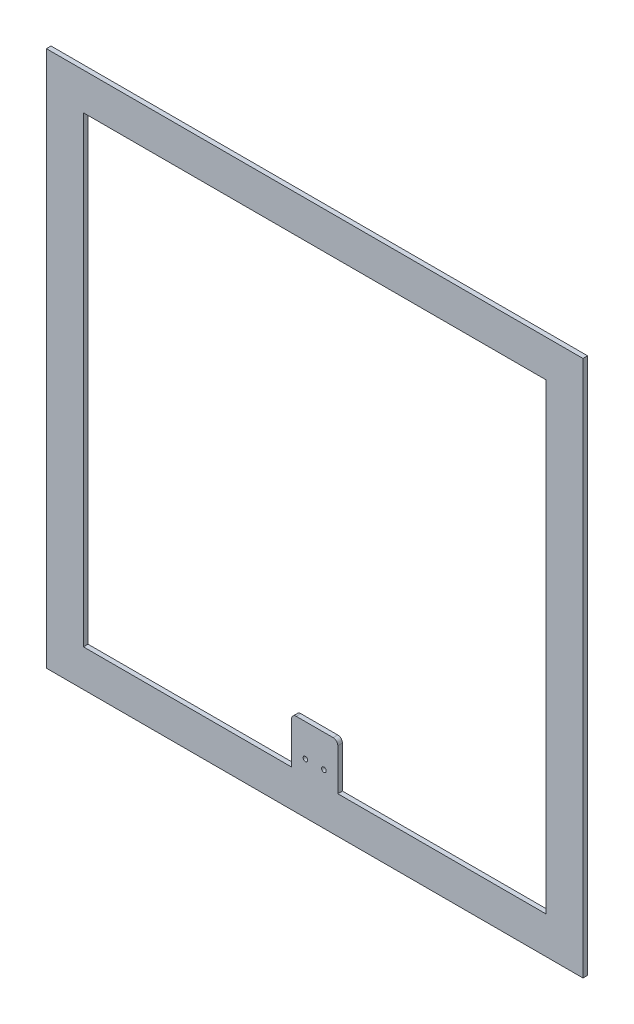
from build123d import *

# Parameters (mm, degrees)
ESQUISSE1_W             = 580
ESQUISSE1_H             = 580
BOSS_EXTRU_1_DEPTH      = 5
ENL_V_MAT_EXTRU_1_REACH = 412.152
ESQUISSE2_R             = 2.5
CONG_1_R                = 5


with BuildPart() as part:
    # Esquisse1 → Boss.-Extru.1 (new body)
    with BuildSketch(Plane.XY):
        Rectangle(ESQUISSE1_W, ESQUISSE1_H)
        Polygon((-250, 250), (250, 250), (250, -250), (25, -250), (25, -200), (-25, -200), (-25, -250), (-250, -250), align=None, mode=Mode.SUBTRACT)
    extrude(amount=BOSS_EXTRU_1_DEPTH)

    # Esquisse2 → Enl_v. mat.-Extru.1 (cut, up to next)
    with BuildSketch(Plane.XY.offset(5), mode=Mode.PRIVATE) as enl_v_mat_extru_1_sk1:
        with Locations((-10, -235)):
            Circle(ESQUISSE2_R)
    enl_v_mat_extru_1_tool1 = extrude(enl_v_mat_extru_1_sk1.sketch, amount=-ENL_V_MAT_EXTRU_1_REACH, mode=Mode.PRIVATE) & part.part
    # Esquisse2 → Enl_v. mat.-Extru.1 (cut, up to next)
    with BuildSketch(Plane.XY.offset(5), mode=Mode.PRIVATE) as enl_v_mat_extru_1_sk2:
        with Locations((10, -235)):
            Circle(ESQUISSE2_R)
    enl_v_mat_extru_1_tool2 = extrude(enl_v_mat_extru_1_sk2.sketch, amount=-ENL_V_MAT_EXTRU_1_REACH, mode=Mode.PRIVATE) & part.part
    add(enl_v_mat_extru_1_tool1.solids().sort_by_distance((-10, -235, 5))[0], mode=Mode.SUBTRACT)
    add(enl_v_mat_extru_1_tool2.solids().sort_by_distance((10, -235, 5))[0], mode=Mode.SUBTRACT)

    # Cong_1
    cong_1_edges = [part.edges().sort_by_distance(p)[0] for p in [
        (-25, -200, 2.5),
        (25, -200, 2.5),
    ]]
    fillet(cong_1_edges, radius=CONG_1_R)


solid = part.part
